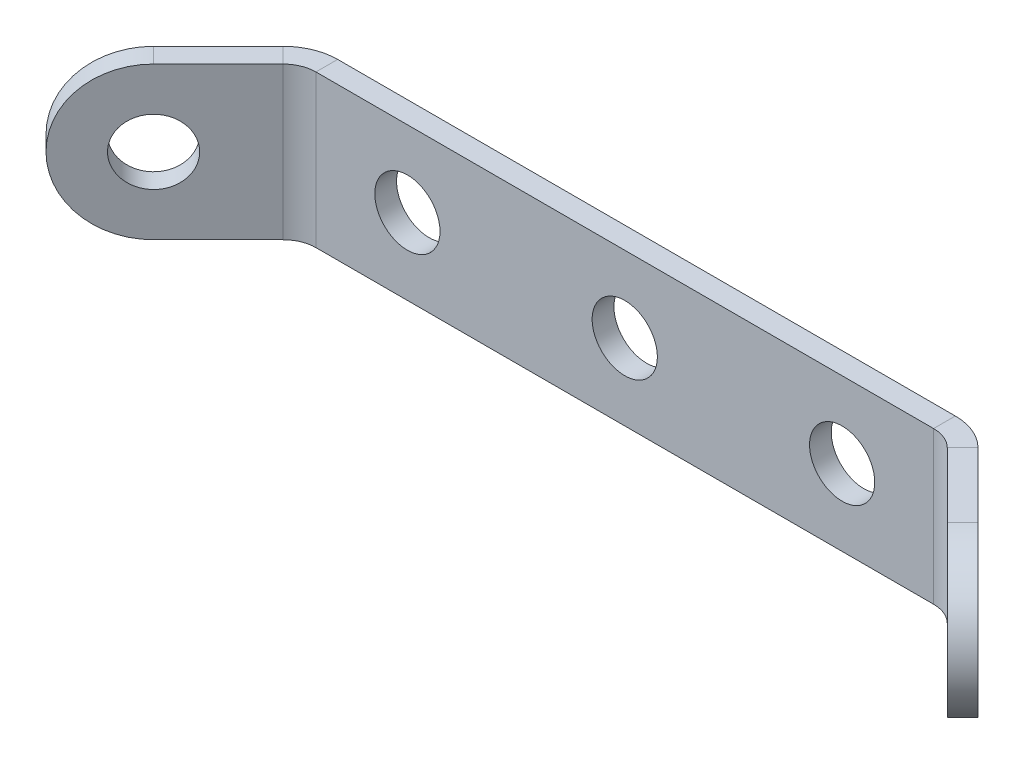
ISO-10303-21;
HEADER;
FILE_DESCRIPTION(('STEP AP214'),'2;1');
FILE_NAME('part.step','',(''),(''),'','','');
FILE_SCHEMA(('AUTOMOTIVE_DESIGN { 1 0 10303 214 1 1 1 1 }'));
ENDSEC;
DATA;
#1=APPLICATION_CONTEXT('core data for automotive mechanical design processes');
#2=APPLICATION_PROTOCOL_DEFINITION('international standard','automotive_design',2000,#1);
#3=PRODUCT_CONTEXT('',#1,'mechanical');
#4=PRODUCT('Part','Part','',(#3));
#5=PRODUCT_RELATED_PRODUCT_CATEGORY('part','',(#4));
#6=PRODUCT_DEFINITION_FORMATION('','',#4);
#7=PRODUCT_DEFINITION_CONTEXT('part definition',#1,'design');
#8=PRODUCT_DEFINITION('design','',#6,#7);
#9=PRODUCT_DEFINITION_SHAPE('','',#8);
#10=(LENGTH_UNIT() NAMED_UNIT(*) SI_UNIT(.MILLI.,.METRE.));
#11=(NAMED_UNIT(*) PLANE_ANGLE_UNIT() SI_UNIT($,.RADIAN.));
#12=(NAMED_UNIT(*) SI_UNIT($,.STERADIAN.) SOLID_ANGLE_UNIT());
#13=UNCERTAINTY_MEASURE_WITH_UNIT(LENGTH_MEASURE(1.E-05),#10,'distance_accuracy_value','');
#14=(GEOMETRIC_REPRESENTATION_CONTEXT(3) GLOBAL_UNCERTAINTY_ASSIGNED_CONTEXT((#13)) GLOBAL_UNIT_ASSIGNED_CONTEXT((#10,
#11,#12)) REPRESENTATION_CONTEXT('',''));
#15=CARTESIAN_POINT('',(0.,0.,0.));
#16=DIRECTION('',(0.,0.,1.));
#17=DIRECTION('',(1.,0.,0.));
#18=AXIS2_PLACEMENT_3D('',#15,#16,#17);
#19=CARTESIAN_POINT('',(-20.,3.5,-1.));
#20=DIRECTION('',(0.,1.,0.));
#21=DIRECTION('',(-1.,0.,0.));
#22=AXIS2_PLACEMENT_3D('',#19,#20,#21);
#23=PLANE('',#22);
#24=DIRECTION('',(-1.,0.,0.));
#25=VECTOR('',#24,1.);
#26=CARTESIAN_POINT('',(-20.,3.5,0.));
#27=LINE('',#26,#25);
#28=CARTESIAN_POINT('',(14.2071719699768,3.50000000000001,0.));
#29=VERTEX_POINT('',#28);
#30=CARTESIAN_POINT('',(-14.2071719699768,3.5,0.));
#31=VERTEX_POINT('',#30);
#32=EDGE_CURVE('E71',#29,#31,#27,.T.);
#33=ORIENTED_EDGE('',*,*,#32,.F.);
#34=DIRECTION('',(0.,0.,-1.));
#35=VECTOR('',#34,1.);
#36=CARTESIAN_POINT('',(14.2071719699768,3.50000000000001,-1.));
#37=LINE('',#36,#35);
#38=CARTESIAN_POINT('',(14.2071719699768,3.50000000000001,-1.));
#39=VERTEX_POINT('',#38);
#40=EDGE_CURVE('E266',#29,#39,#37,.T.);
#41=ORIENTED_EDGE('',*,*,#40,.T.);
#42=DIRECTION('',(-1.,0.,0.));
#43=VECTOR('',#42,1.);
#44=CARTESIAN_POINT('',(-20.,3.5,-1.));
#45=LINE('',#44,#43);
#46=CARTESIAN_POINT('',(-14.2071719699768,3.5,-1.));
#47=VERTEX_POINT('',#46);
#48=EDGE_CURVE('E50',#39,#47,#45,.T.);
#49=ORIENTED_EDGE('',*,*,#48,.T.);
#50=DIRECTION('',(0.,0.,-1.));
#51=VECTOR('',#50,1.);
#52=CARTESIAN_POINT('',(-14.2071719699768,3.5,-1.));
#53=LINE('',#52,#51);
#54=EDGE_CURVE('E261',#31,#47,#53,.T.);
#55=ORIENTED_EDGE('',*,*,#54,.F.);
#56=EDGE_LOOP('',(#33,#41,#49,#55));
#57=FACE_BOUND('',#56,.T.);
#58=ADVANCED_FACE('F46',(#57),#23,.T.);
#59=CARTESIAN_POINT('',(-20.,-3.5,-1.));
#60=DIRECTION('',(0.,-1.,0.));
#61=DIRECTION('',(1.,0.,0.));
#62=AXIS2_PLACEMENT_3D('',#59,#60,#61);
#63=PLANE('',#62);
#64=DIRECTION('',(1.,0.,0.));
#65=VECTOR('',#64,1.);
#66=CARTESIAN_POINT('',(-20.,-3.5,-1.));
#67=LINE('',#66,#65);
#68=CARTESIAN_POINT('',(-14.2071719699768,-3.5,-1.));
#69=VERTEX_POINT('',#68);
#70=CARTESIAN_POINT('',(14.2071719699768,-3.49999999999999,-1.));
#71=VERTEX_POINT('',#70);
#72=EDGE_CURVE('E270',#69,#71,#67,.T.);
#73=ORIENTED_EDGE('',*,*,#72,.T.);
#74=DIRECTION('',(0.,0.,1.));
#75=VECTOR('',#74,1.);
#76=CARTESIAN_POINT('',(14.2071719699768,-3.49999999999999,-1.));
#77=LINE('',#76,#75);
#78=CARTESIAN_POINT('',(14.2071719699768,-3.49999999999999,0.));
#79=VERTEX_POINT('',#78);
#80=EDGE_CURVE('E12',#71,#79,#77,.T.);
#81=ORIENTED_EDGE('',*,*,#80,.T.);
#82=DIRECTION('',(1.,0.,0.));
#83=VECTOR('',#82,1.);
#84=CARTESIAN_POINT('',(-20.,-3.5,0.));
#85=LINE('',#84,#83);
#86=CARTESIAN_POINT('',(-14.2071719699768,-3.5,0.));
#87=VERTEX_POINT('',#86);
#88=EDGE_CURVE('E250',#87,#79,#85,.T.);
#89=ORIENTED_EDGE('',*,*,#88,.F.);
#90=DIRECTION('',(0.,0.,1.));
#91=VECTOR('',#90,1.);
#92=CARTESIAN_POINT('',(-14.2071719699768,-3.5,-1.));
#93=LINE('',#92,#91);
#94=EDGE_CURVE('E255',#69,#87,#93,.T.);
#95=ORIENTED_EDGE('',*,*,#94,.F.);
#96=EDGE_LOOP('',(#73,#81,#89,#95));
#97=FACE_BOUND('',#96,.T.);
#98=ADVANCED_FACE('F48',(#97),#63,.T.);
#99=CARTESIAN_POINT('',(-20.,0.,0.));
#100=DIRECTION('',(0.,0.,1.));
#101=DIRECTION('',(1.,0.,0.));
#102=AXIS2_PLACEMENT_3D('',#99,#100,#101);
#103=PLANE('',#102);
#104=CARTESIAN_POINT('',(0.,0.,0.));
#105=DIRECTION('',(0.,0.,1.));
#106=DIRECTION('',(1.,0.,0.));
#107=AXIS2_PLACEMENT_3D('',#104,#105,#106);
#108=CIRCLE('',#107,1.5);
#109=CARTESIAN_POINT('',(1.5,0.,0.));
#110=VERTEX_POINT('',#109);
#111=EDGE_CURVE('E244',#110,#110,#108,.T.);
#112=ORIENTED_EDGE('',*,*,#111,.F.);
#113=EDGE_LOOP('',(#112));
#114=FACE_BOUND('',#113,.T.);
#115=CARTESIAN_POINT('',(10.,0.,0.));
#116=DIRECTION('',(0.,0.,1.));
#117=DIRECTION('',(1.,0.,0.));
#118=AXIS2_PLACEMENT_3D('',#115,#116,#117);
#119=CIRCLE('',#118,1.5);
#120=CARTESIAN_POINT('',(11.5,0.,0.));
#121=VERTEX_POINT('',#120);
#122=EDGE_CURVE('E238',#121,#121,#119,.T.);
#123=ORIENTED_EDGE('',*,*,#122,.F.);
#124=EDGE_LOOP('',(#123));
#125=FACE_BOUND('',#124,.T.);
#126=CARTESIAN_POINT('',(-10.,0.,0.));
#127=DIRECTION('',(0.,0.,1.));
#128=DIRECTION('',(1.,0.,0.));
#129=AXIS2_PLACEMENT_3D('',#126,#127,#128);
#130=CIRCLE('',#129,1.5);
#131=CARTESIAN_POINT('',(-8.5,0.,0.));
#132=VERTEX_POINT('',#131);
#133=EDGE_CURVE('E230',#132,#132,#130,.T.);
#134=ORIENTED_EDGE('',*,*,#133,.F.);
#135=EDGE_LOOP('',(#134));
#136=FACE_BOUND('',#135,.T.);
#137=ORIENTED_EDGE('',*,*,#88,.T.);
#138=DIRECTION('',(0.,1.,0.));
#139=VECTOR('',#138,1.);
#140=CARTESIAN_POINT('',(14.2071719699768,0.,0.));
#141=LINE('',#140,#139);
#142=EDGE_CURVE('E55',#79,#29,#141,.T.);
#143=ORIENTED_EDGE('',*,*,#142,.T.);
#144=ORIENTED_EDGE('',*,*,#32,.T.);
#145=DIRECTION('',(0.,1.,0.));
#146=VECTOR('',#145,1.);
#147=CARTESIAN_POINT('',(-14.2071719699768,0.,0.));
#148=LINE('',#147,#146);
#149=EDGE_CURVE('E258',#87,#31,#148,.T.);
#150=ORIENTED_EDGE('',*,*,#149,.F.);
#151=EDGE_LOOP('',(#137,#143,#144,#150));
#152=FACE_BOUND('',#151,.T.);
#153=ADVANCED_FACE('F274',(#114,#125,#136,#152),#103,.T.);
#154=CARTESIAN_POINT('',(-20.,0.,-1.));
#155=DIRECTION('',(0.,0.,1.));
#156=DIRECTION('',(1.,0.,0.));
#157=AXIS2_PLACEMENT_3D('',#154,#155,#156);
#158=PLANE('',#157);
#159=DIRECTION('',(0.,1.,0.));
#160=VECTOR('',#159,1.);
#161=CARTESIAN_POINT('',(14.2071719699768,0.,-1.));
#162=LINE('',#161,#160);
#163=EDGE_CURVE('E264',#71,#39,#162,.T.);
#164=ORIENTED_EDGE('',*,*,#163,.F.);
#165=ORIENTED_EDGE('',*,*,#72,.F.);
#166=DIRECTION('',(0.,1.,0.));
#167=VECTOR('',#166,1.);
#168=CARTESIAN_POINT('',(-14.2071719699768,0.,-1.));
#169=LINE('',#168,#167);
#170=EDGE_CURVE('E253',#69,#47,#169,.T.);
#171=ORIENTED_EDGE('',*,*,#170,.T.);
#172=ORIENTED_EDGE('',*,*,#48,.F.);
#173=EDGE_LOOP('',(#164,#165,#171,#172));
#174=FACE_BOUND('',#173,.T.);
#175=CARTESIAN_POINT('',(0.,0.,-1.));
#176=DIRECTION('',(0.,0.,1.));
#177=DIRECTION('',(1.,0.,0.));
#178=AXIS2_PLACEMENT_3D('',#175,#176,#177);
#179=CIRCLE('',#178,1.5);
#180=CARTESIAN_POINT('',(1.5,0.,-1.));
#181=VERTEX_POINT('',#180);
#182=EDGE_CURVE('E247',#181,#181,#179,.T.);
#183=ORIENTED_EDGE('',*,*,#182,.T.);
#184=EDGE_LOOP('',(#183));
#185=FACE_BOUND('',#184,.T.);
#186=CARTESIAN_POINT('',(10.,0.,-1.));
#187=DIRECTION('',(0.,0.,1.));
#188=DIRECTION('',(1.,0.,0.));
#189=AXIS2_PLACEMENT_3D('',#186,#187,#188);
#190=CIRCLE('',#189,1.5);
#191=CARTESIAN_POINT('',(11.5,0.,-1.));
#192=VERTEX_POINT('',#191);
#193=EDGE_CURVE('E241',#192,#192,#190,.T.);
#194=ORIENTED_EDGE('',*,*,#193,.T.);
#195=EDGE_LOOP('',(#194));
#196=FACE_BOUND('',#195,.T.);
#197=CARTESIAN_POINT('',(-10.,0.,-1.));
#198=DIRECTION('',(0.,0.,1.));
#199=DIRECTION('',(1.,0.,0.));
#200=AXIS2_PLACEMENT_3D('',#197,#198,#199);
#201=CIRCLE('',#200,1.5);
#202=CARTESIAN_POINT('',(-8.5,0.,-1.));
#203=VERTEX_POINT('',#202);
#204=EDGE_CURVE('E235',#203,#203,#201,.T.);
#205=ORIENTED_EDGE('',*,*,#204,.T.);
#206=EDGE_LOOP('',(#205));
#207=FACE_BOUND('',#206,.T.);
#208=ADVANCED_FACE('F286',(#174,#185,#196,#207),#158,.F.);
#209=CARTESIAN_POINT('',(0.,0.,-1.));
#210=DIRECTION('',(0.,0.,1.));
#211=DIRECTION('',(1.,0.,0.));
#212=AXIS2_PLACEMENT_3D('',#209,#210,#211);
#213=CYLINDRICAL_SURFACE('',#212,1.5);
#214=ORIENTED_EDGE('',*,*,#182,.F.);
#215=EDGE_LOOP('',(#214));
#216=FACE_BOUND('',#215,.T.);
#217=ORIENTED_EDGE('',*,*,#111,.T.);
#218=EDGE_LOOP('',(#217));
#219=FACE_BOUND('',#218,.T.);
#220=ADVANCED_FACE('F336',(#216,#219),#213,.F.);
#221=CARTESIAN_POINT('',(10.,0.,-1.));
#222=DIRECTION('',(0.,0.,1.));
#223=DIRECTION('',(1.,0.,0.));
#224=AXIS2_PLACEMENT_3D('',#221,#222,#223);
#225=CYLINDRICAL_SURFACE('',#224,1.5);
#226=ORIENTED_EDGE('',*,*,#193,.F.);
#227=EDGE_LOOP('',(#226));
#228=FACE_BOUND('',#227,.T.);
#229=ORIENTED_EDGE('',*,*,#122,.T.);
#230=EDGE_LOOP('',(#229));
#231=FACE_BOUND('',#230,.T.);
#232=ADVANCED_FACE('F346',(#228,#231),#225,.F.);
#233=CARTESIAN_POINT('',(-10.,0.,-1.));
#234=DIRECTION('',(0.,0.,1.));
#235=DIRECTION('',(1.,0.,0.));
#236=AXIS2_PLACEMENT_3D('',#233,#234,#235);
#237=CYLINDRICAL_SURFACE('',#236,1.5);
#238=ORIENTED_EDGE('',*,*,#204,.F.);
#239=EDGE_LOOP('',(#238));
#240=FACE_BOUND('',#239,.T.);
#241=ORIENTED_EDGE('',*,*,#133,.T.);
#242=EDGE_LOOP('',(#241));
#243=FACE_BOUND('',#242,.T.);
#244=ADVANCED_FACE('F343',(#240,#243),#237,.F.);
#245=CARTESIAN_POINT('',(-14.2071719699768,-3.5,1.51892));
#246=DIRECTION('',(0.,-1.,0.));
#247=DIRECTION('',(0.,0.,-1.));
#248=AXIS2_PLACEMENT_3D('',#245,#246,#247);
#249=PLANE('',#248);
#250=ORIENTED_EDGE('',*,*,#94,.T.);
#251=CARTESIAN_POINT('',(-14.2071719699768,-3.5,1.51892));
#252=DIRECTION('',(0.,1.,0.));
#253=DIRECTION('',(0.,0.,1.));
#254=AXIS2_PLACEMENT_3D('',#251,#252,#253);
#255=CIRCLE('',#254,1.51892);
#256=CARTESIAN_POINT('',(-15.2812106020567,-3.5,0.444881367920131));
#257=VERTEX_POINT('',#256);
#258=EDGE_CURVE('E189',#87,#257,#255,.T.);
#259=ORIENTED_EDGE('',*,*,#258,.T.);
#260=DIRECTION('',(0.707106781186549,0.,0.707106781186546));
#261=VECTOR('',#260,1.);
#262=CARTESIAN_POINT('',(-15.9883173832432,-3.5,-0.262225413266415));
#263=LINE('',#262,#261);
#264=CARTESIAN_POINT('',(-15.9883173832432,-3.5,-0.262225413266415));
#265=VERTEX_POINT('',#264);
#266=EDGE_CURVE('E204',#265,#257,#263,.T.);
#267=ORIENTED_EDGE('',*,*,#266,.F.);
#268=CARTESIAN_POINT('',(-14.2071719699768,-3.5,1.51892));
#269=DIRECTION('',(0.,1.,0.));
#270=DIRECTION('',(0.,0.,-1.));
#271=AXIS2_PLACEMENT_3D('',#268,#269,#270);
#272=CIRCLE('',#271,2.51892);
#273=EDGE_CURVE('E223',#69,#265,#272,.T.);
#274=ORIENTED_EDGE('',*,*,#273,.F.);
#275=EDGE_LOOP('',(#250,#259,#267,#274));
#276=FACE_BOUND('',#275,.T.);
#277=ADVANCED_FACE('F345',(#276),#249,.T.);
#278=CARTESIAN_POINT('',(-14.2071719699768,3.5,1.51892));
#279=DIRECTION('',(0.,1.,0.));
#280=DIRECTION('',(0.,0.,1.));
#281=AXIS2_PLACEMENT_3D('',#278,#279,#280);
#282=PLANE('',#281);
#283=DIRECTION('',(-0.707106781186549,0.,-0.707106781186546));
#284=VECTOR('',#283,1.);
#285=CARTESIAN_POINT('',(-15.9883173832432,3.5,-0.262225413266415));
#286=LINE('',#285,#284);
#287=CARTESIAN_POINT('',(-15.2812106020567,3.5,0.444881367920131));
#288=VERTEX_POINT('',#287);
#289=CARTESIAN_POINT('',(-15.9883173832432,3.5,-0.262225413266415));
#290=VERTEX_POINT('',#289);
#291=EDGE_CURVE('E192',#288,#290,#286,.T.);
#292=ORIENTED_EDGE('',*,*,#291,.F.);
#293=CARTESIAN_POINT('',(-14.2071719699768,3.49999999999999,1.51892));
#294=DIRECTION('',(0.,1.,0.));
#295=DIRECTION('',(0.,0.,1.));
#296=AXIS2_PLACEMENT_3D('',#293,#294,#295);
#297=CIRCLE('',#296,1.51892);
#298=EDGE_CURVE('E227',#288,#31,#297,.F.);
#299=ORIENTED_EDGE('',*,*,#298,.T.);
#300=ORIENTED_EDGE('',*,*,#54,.T.);
#301=CARTESIAN_POINT('',(-14.2071719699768,3.5,1.51892));
#302=DIRECTION('',(0.,-1.,0.));
#303=DIRECTION('',(0.,0.,1.));
#304=AXIS2_PLACEMENT_3D('',#301,#302,#303);
#305=CIRCLE('',#304,2.51892);
#306=EDGE_CURVE('E226',#290,#47,#305,.T.);
#307=ORIENTED_EDGE('',*,*,#306,.F.);
#308=EDGE_LOOP('',(#292,#299,#300,#307));
#309=FACE_BOUND('',#308,.T.);
#310=ADVANCED_FACE('F353',(#309),#282,.T.);
#311=CARTESIAN_POINT('',(-14.2071719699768,-7.24667545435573,1.51892));
#312=DIRECTION('',(0.,1.,0.));
#313=DIRECTION('',(0.,0.,1.));
#314=AXIS2_PLACEMENT_3D('',#311,#312,#313);
#315=CYLINDRICAL_SURFACE('',#314,2.51892);
#316=ORIENTED_EDGE('',*,*,#306,.T.);
#317=ORIENTED_EDGE('',*,*,#170,.F.);
#318=ORIENTED_EDGE('',*,*,#273,.T.);
#319=DIRECTION('',(0.,1.,0.));
#320=VECTOR('',#319,1.);
#321=CARTESIAN_POINT('',(-15.9883173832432,0.,-0.262225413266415));
#322=LINE('',#321,#320);
#323=EDGE_CURVE('E182',#265,#290,#322,.T.);
#324=ORIENTED_EDGE('',*,*,#323,.T.);
#325=EDGE_LOOP('',(#316,#317,#318,#324));
#326=FACE_BOUND('',#325,.T.);
#327=ADVANCED_FACE('F421',(#326),#315,.T.);
#328=CARTESIAN_POINT('',(-14.2071719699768,-7.24667545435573,1.51892));
#329=DIRECTION('',(0.,1.,0.));
#330=DIRECTION('',(0.,0.,1.));
#331=AXIS2_PLACEMENT_3D('',#328,#329,#330);
#332=CYLINDRICAL_SURFACE('',#331,1.51892);
#333=ORIENTED_EDGE('',*,*,#298,.F.);
#334=DIRECTION('',(0.,1.,0.));
#335=VECTOR('',#334,1.);
#336=CARTESIAN_POINT('',(-15.2812106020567,0.,0.444881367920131));
#337=LINE('',#336,#335);
#338=EDGE_CURVE('E199',#257,#288,#337,.T.);
#339=ORIENTED_EDGE('',*,*,#338,.F.);
#340=ORIENTED_EDGE('',*,*,#258,.F.);
#341=ORIENTED_EDGE('',*,*,#149,.T.);
#342=EDGE_LOOP('',(#333,#339,#340,#341));
#343=FACE_BOUND('',#342,.T.);
#344=ADVANCED_FACE('F431',(#343),#332,.F.);
#345=CARTESIAN_POINT('',(-18.9632372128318,0.,2.71269441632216));
#346=DIRECTION('',(0.707106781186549,0.,0.707106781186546));
#347=DIRECTION('',(0.707106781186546,0.,-0.707106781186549));
#348=AXIS2_PLACEMENT_3D('',#345,#346,#347);
#349=CYLINDRICAL_SURFACE('',#348,1.5);
#350=CARTESIAN_POINT('',(-18.9632372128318,0.,2.71269441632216));
#351=DIRECTION('',(0.707106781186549,0.,0.707106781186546));
#352=DIRECTION('',(0.707106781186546,0.,-0.707106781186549));
#353=AXIS2_PLACEMENT_3D('',#350,#351,#352);
#354=CIRCLE('',#353,1.5);
#355=CARTESIAN_POINT('',(-17.902577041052,0.,1.65203424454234));
#356=VERTEX_POINT('',#355);
#357=EDGE_CURVE('E210',#356,#356,#354,.T.);
#358=ORIENTED_EDGE('',*,*,#357,.F.);
#359=EDGE_LOOP('',(#358));
#360=FACE_BOUND('',#359,.T.);
#361=CARTESIAN_POINT('',(-18.2561304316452,0.,3.41980119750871));
#362=DIRECTION('',(0.707106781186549,0.,0.707106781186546));
#363=DIRECTION('',(0.707106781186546,0.,-0.707106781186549));
#364=AXIS2_PLACEMENT_3D('',#361,#362,#363);
#365=CIRCLE('',#364,1.5);
#366=CARTESIAN_POINT('',(-17.1954702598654,0.,2.35914102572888));
#367=VERTEX_POINT('',#366);
#368=EDGE_CURVE('E218',#367,#367,#365,.T.);
#369=ORIENTED_EDGE('',*,*,#368,.T.);
#370=EDGE_LOOP('',(#369));
#371=FACE_BOUND('',#370,.T.);
#372=ADVANCED_FACE('F442',(#360,#371),#349,.F.);
#373=CARTESIAN_POINT('',(-18.9632372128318,0.,2.71269441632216));
#374=DIRECTION('',(0.707106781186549,0.,0.707106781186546));
#375=DIRECTION('',(0.707106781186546,0.,-0.707106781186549));
#376=AXIS2_PLACEMENT_3D('',#373,#374,#375);
#377=CYLINDRICAL_SURFACE('',#376,3.5);
#378=CARTESIAN_POINT('',(-18.2561304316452,0.,3.41980119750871));
#379=DIRECTION('',(0.707106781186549,0.,0.707106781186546));
#380=DIRECTION('',(0.707106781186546,0.,-0.707106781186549));
#381=AXIS2_PLACEMENT_3D('',#378,#379,#380);
#382=CIRCLE('',#381,3.5);
#383=CARTESIAN_POINT('',(-18.2561304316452,3.5,3.41980119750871));
#384=VERTEX_POINT('',#383);
#385=CARTESIAN_POINT('',(-18.2561304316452,-3.5,3.41980119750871));
#386=VERTEX_POINT('',#385);
#387=EDGE_CURVE('E194',#384,#386,#382,.T.);
#388=ORIENTED_EDGE('',*,*,#387,.F.);
#389=DIRECTION('',(0.707106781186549,0.,0.707106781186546));
#390=VECTOR('',#389,1.);
#391=CARTESIAN_POINT('',(-18.9632372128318,3.5,2.71269441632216));
#392=LINE('',#391,#390);
#393=CARTESIAN_POINT('',(-18.9632372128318,3.5,2.71269441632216));
#394=VERTEX_POINT('',#393);
#395=EDGE_CURVE('E186',#394,#384,#392,.T.);
#396=ORIENTED_EDGE('',*,*,#395,.F.);
#397=CARTESIAN_POINT('',(-18.9632372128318,0.,2.71269441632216));
#398=DIRECTION('',(0.707106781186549,0.,0.707106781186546));
#399=DIRECTION('',(0.707106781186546,0.,-0.707106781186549));
#400=AXIS2_PLACEMENT_3D('',#397,#398,#399);
#401=CIRCLE('',#400,3.5);
#402=CARTESIAN_POINT('',(-18.9632372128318,-3.5,2.71269441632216));
#403=VERTEX_POINT('',#402);
#404=EDGE_CURVE('E215',#394,#403,#401,.T.);
#405=ORIENTED_EDGE('',*,*,#404,.T.);
#406=DIRECTION('',(0.707106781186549,0.,0.707106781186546));
#407=VECTOR('',#406,1.);
#408=CARTESIAN_POINT('',(-18.9632372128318,-3.5,2.71269441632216));
#409=LINE('',#408,#407);
#410=EDGE_CURVE('E213',#403,#386,#409,.T.);
#411=ORIENTED_EDGE('',*,*,#410,.T.);
#412=EDGE_LOOP('',(#388,#396,#405,#411));
#413=FACE_BOUND('',#412,.T.);
#414=ADVANCED_FACE('F453',(#413),#377,.T.);
#415=CARTESIAN_POINT('',(-18.9632372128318,0.,2.71269441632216));
#416=DIRECTION('',(0.707106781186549,0.,0.707106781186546));
#417=DIRECTION('',(0.707106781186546,0.,-0.707106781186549));
#418=AXIS2_PLACEMENT_3D('',#415,#416,#417);
#419=PLANE('',#418);
#420=ORIENTED_EDGE('',*,*,#323,.F.);
#421=DIRECTION('',(0.707106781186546,0.,-0.707106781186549));
#422=VECTOR('',#421,1.);
#423=CARTESIAN_POINT('',(-18.9632372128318,-3.5,2.71269441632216));
#424=LINE('',#423,#422);
#425=EDGE_CURVE('E207',#403,#265,#424,.T.);
#426=ORIENTED_EDGE('',*,*,#425,.F.);
#427=ORIENTED_EDGE('',*,*,#404,.F.);
#428=DIRECTION('',(-0.707106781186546,0.,0.707106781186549));
#429=VECTOR('',#428,1.);
#430=CARTESIAN_POINT('',(-18.9632372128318,3.5,2.71269441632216));
#431=LINE('',#430,#429);
#432=EDGE_CURVE('E190',#290,#394,#431,.T.);
#433=ORIENTED_EDGE('',*,*,#432,.F.);
#434=EDGE_LOOP('',(#420,#426,#427,#433));
#435=FACE_BOUND('',#434,.T.);
#436=ORIENTED_EDGE('',*,*,#357,.T.);
#437=EDGE_LOOP('',(#436));
#438=FACE_BOUND('',#437,.T.);
#439=ADVANCED_FACE('F464',(#435,#438),#419,.F.);
#440=CARTESIAN_POINT('',(-18.9632372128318,-3.5,2.71269441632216));
#441=DIRECTION('',(0.,-1.,0.));
#442=DIRECTION('',(0.707106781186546,0.,-0.707106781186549));
#443=AXIS2_PLACEMENT_3D('',#440,#441,#442);
#444=PLANE('',#443);
#445=ORIENTED_EDGE('',*,*,#425,.T.);
#446=ORIENTED_EDGE('',*,*,#266,.T.);
#447=DIRECTION('',(0.707106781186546,0.,-0.707106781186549));
#448=VECTOR('',#447,1.);
#449=CARTESIAN_POINT('',(-18.2561304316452,-3.5,3.41980119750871));
#450=LINE('',#449,#448);
#451=EDGE_CURVE('E202',#386,#257,#450,.T.);
#452=ORIENTED_EDGE('',*,*,#451,.F.);
#453=ORIENTED_EDGE('',*,*,#410,.F.);
#454=EDGE_LOOP('',(#445,#446,#452,#453));
#455=FACE_BOUND('',#454,.T.);
#456=ADVANCED_FACE('F475',(#455),#444,.T.);
#457=CARTESIAN_POINT('',(-18.2561304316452,0.,3.41980119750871));
#458=DIRECTION('',(0.707106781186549,0.,0.707106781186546));
#459=DIRECTION('',(0.707106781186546,0.,-0.707106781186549));
#460=AXIS2_PLACEMENT_3D('',#457,#458,#459);
#461=PLANE('',#460);
#462=ORIENTED_EDGE('',*,*,#368,.F.);
#463=EDGE_LOOP('',(#462));
#464=FACE_BOUND('',#463,.T.);
#465=ORIENTED_EDGE('',*,*,#451,.T.);
#466=ORIENTED_EDGE('',*,*,#338,.T.);
#467=DIRECTION('',(-0.707106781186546,0.,0.707106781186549));
#468=VECTOR('',#467,1.);
#469=CARTESIAN_POINT('',(-18.2561304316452,3.5,3.41980119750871));
#470=LINE('',#469,#468);
#471=EDGE_CURVE('E197',#288,#384,#470,.T.);
#472=ORIENTED_EDGE('',*,*,#471,.T.);
#473=ORIENTED_EDGE('',*,*,#387,.T.);
#474=EDGE_LOOP('',(#465,#466,#472,#473));
#475=FACE_BOUND('',#474,.T.);
#476=ADVANCED_FACE('F486',(#464,#475),#461,.T.);
#477=CARTESIAN_POINT('',(-18.9632372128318,3.5,2.71269441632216));
#478=DIRECTION('',(0.,1.,0.));
#479=DIRECTION('',(-0.707106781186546,0.,0.707106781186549));
#480=AXIS2_PLACEMENT_3D('',#477,#478,#479);
#481=PLANE('',#480);
#482=ORIENTED_EDGE('',*,*,#471,.F.);
#483=ORIENTED_EDGE('',*,*,#291,.T.);
#484=ORIENTED_EDGE('',*,*,#432,.T.);
#485=ORIENTED_EDGE('',*,*,#395,.T.);
#486=EDGE_LOOP('',(#482,#483,#484,#485));
#487=FACE_BOUND('',#486,.T.);
#488=ADVANCED_FACE('F497',(#487),#481,.T.);
#489=CARTESIAN_POINT('',(14.2071719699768,-3.49999999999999,1.51892));
#490=DIRECTION('',(0.,-1.,0.));
#491=DIRECTION('',(0.,0.,-1.));
#492=AXIS2_PLACEMENT_3D('',#489,#490,#491);
#493=PLANE('',#492);
#494=DIRECTION('',(-0.707106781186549,0.,0.707106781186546));
#495=VECTOR('',#494,1.);
#496=CARTESIAN_POINT('',(15.9883173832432,-3.49999999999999,-0.262225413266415));
#497=LINE('',#496,#495);
#498=CARTESIAN_POINT('',(15.9883173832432,-3.49999999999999,-0.262225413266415));
#499=VERTEX_POINT('',#498);
#500=CARTESIAN_POINT('',(15.2812106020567,-3.49999999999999,0.444881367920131));
#501=VERTEX_POINT('',#500);
#502=EDGE_CURVE('E145',#499,#501,#497,.T.);
#503=ORIENTED_EDGE('',*,*,#502,.T.);
#504=CARTESIAN_POINT('',(14.2071719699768,-3.49999999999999,1.51892));
#505=DIRECTION('',(0.,-1.,0.));
#506=DIRECTION('',(0.,0.,-1.));
#507=AXIS2_PLACEMENT_3D('',#504,#505,#506);
#508=CIRCLE('',#507,1.51892);
#509=EDGE_CURVE('E63',#501,#79,#508,.F.);
#510=ORIENTED_EDGE('',*,*,#509,.T.);
#511=ORIENTED_EDGE('',*,*,#80,.F.);
#512=CARTESIAN_POINT('',(14.2071719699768,-3.49999999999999,1.51892));
#513=DIRECTION('',(0.,1.,0.));
#514=DIRECTION('',(0.,0.,-1.));
#515=AXIS2_PLACEMENT_3D('',#512,#513,#514);
#516=CIRCLE('',#515,2.51892);
#517=EDGE_CURVE('E175',#499,#71,#516,.T.);
#518=ORIENTED_EDGE('',*,*,#517,.F.);
#519=EDGE_LOOP('',(#503,#510,#511,#518));
#520=FACE_BOUND('',#519,.T.);
#521=ADVANCED_FACE('F277',(#520),#493,.T.);
#522=CARTESIAN_POINT('',(14.2071719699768,3.50000000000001,1.51892));
#523=DIRECTION('',(0.,1.,0.));
#524=DIRECTION('',(0.,0.,1.));
#525=AXIS2_PLACEMENT_3D('',#522,#523,#524);
#526=PLANE('',#525);
#527=ORIENTED_EDGE('',*,*,#40,.F.);
#528=CARTESIAN_POINT('',(14.2071719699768,3.50000000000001,1.51892));
#529=DIRECTION('',(0.,-1.,0.));
#530=DIRECTION('',(0.,0.,-1.));
#531=AXIS2_PLACEMENT_3D('',#528,#529,#530);
#532=CIRCLE('',#531,1.51892);
#533=CARTESIAN_POINT('',(15.2812106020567,3.50000000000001,0.444881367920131));
#534=VERTEX_POINT('',#533);
#535=EDGE_CURVE('E179',#29,#534,#532,.T.);
#536=ORIENTED_EDGE('',*,*,#535,.T.);
#537=DIRECTION('',(0.707106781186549,0.,-0.707106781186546));
#538=VECTOR('',#537,1.);
#539=CARTESIAN_POINT('',(15.9883173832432,3.50000000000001,-0.262225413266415));
#540=LINE('',#539,#538);
#541=CARTESIAN_POINT('',(15.9883173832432,3.50000000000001,-0.262225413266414));
#542=VERTEX_POINT('',#541);
#543=EDGE_CURVE('E163',#534,#542,#540,.T.);
#544=ORIENTED_EDGE('',*,*,#543,.T.);
#545=CARTESIAN_POINT('',(14.2071719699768,3.50000000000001,1.51892));
#546=DIRECTION('',(0.,-1.,0.));
#547=DIRECTION('',(0.,0.,1.));
#548=AXIS2_PLACEMENT_3D('',#545,#546,#547);
#549=CIRCLE('',#548,2.51892);
#550=EDGE_CURVE('E178',#39,#542,#549,.T.);
#551=ORIENTED_EDGE('',*,*,#550,.F.);
#552=EDGE_LOOP('',(#527,#536,#544,#551));
#553=FACE_BOUND('',#552,.T.);
#554=ADVANCED_FACE('F293',(#553),#526,.T.);
#555=CARTESIAN_POINT('',(14.2071719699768,7.24667545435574,1.51892));
#556=DIRECTION('',(0.,-1.,0.));
#557=DIRECTION('',(0.,0.,-1.));
#558=AXIS2_PLACEMENT_3D('',#555,#556,#557);
#559=CYLINDRICAL_SURFACE('',#558,2.51892);
#560=ORIENTED_EDGE('',*,*,#550,.T.);
#561=DIRECTION('',(0.,1.,0.));
#562=VECTOR('',#561,1.);
#563=CARTESIAN_POINT('',(15.9883173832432,0.,-0.262225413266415));
#564=LINE('',#563,#562);
#565=EDGE_CURVE('E283',#499,#542,#564,.T.);
#566=ORIENTED_EDGE('',*,*,#565,.F.);
#567=ORIENTED_EDGE('',*,*,#517,.T.);
#568=ORIENTED_EDGE('',*,*,#163,.T.);
#569=EDGE_LOOP('',(#560,#566,#567,#568));
#570=FACE_BOUND('',#569,.T.);
#571=ADVANCED_FACE('F281',(#570),#559,.T.);
#572=CARTESIAN_POINT('',(14.2071719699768,7.24667545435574,1.51892));
#573=DIRECTION('',(0.,-1.,0.));
#574=DIRECTION('',(0.,0.,-1.));
#575=AXIS2_PLACEMENT_3D('',#572,#573,#574);
#576=CYLINDRICAL_SURFACE('',#575,1.51892);
#577=ORIENTED_EDGE('',*,*,#535,.F.);
#578=ORIENTED_EDGE('',*,*,#142,.F.);
#579=ORIENTED_EDGE('',*,*,#509,.F.);
#580=DIRECTION('',(0.,1.,0.));
#581=VECTOR('',#580,1.);
#582=CARTESIAN_POINT('',(15.2812106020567,0.,0.444881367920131));
#583=LINE('',#582,#581);
#584=EDGE_CURVE('E168',#501,#534,#583,.T.);
#585=ORIENTED_EDGE('',*,*,#584,.T.);
#586=EDGE_LOOP('',(#577,#578,#579,#585));
#587=FACE_BOUND('',#586,.T.);
#588=ADVANCED_FACE('F295',(#587),#576,.F.);
#589=CARTESIAN_POINT('',(18.9632372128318,0.,2.71269441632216));
#590=DIRECTION('',(-0.707106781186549,0.,0.707106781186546));
#591=DIRECTION('',(0.707106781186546,0.,0.707106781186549));
#592=AXIS2_PLACEMENT_3D('',#589,#590,#591);
#593=CYLINDRICAL_SURFACE('',#592,3.5);
#594=CARTESIAN_POINT('',(18.2561304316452,0.,3.41980119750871));
#595=DIRECTION('',(-0.707106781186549,0.,0.707106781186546));
#596=DIRECTION('',(0.707106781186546,0.,0.707106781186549));
#597=AXIS2_PLACEMENT_3D('',#594,#595,#596);
#598=CIRCLE('',#597,3.5);
#599=CARTESIAN_POINT('',(18.2561304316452,-3.49999999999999,3.41980119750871));
#600=VERTEX_POINT('',#599);
#601=CARTESIAN_POINT('',(18.2561304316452,3.50000000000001,3.41980119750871));
#602=VERTEX_POINT('',#601);
#603=EDGE_CURVE('E158',#600,#602,#598,.T.);
#604=ORIENTED_EDGE('',*,*,#603,.F.);
#605=DIRECTION('',(-0.707106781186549,0.,0.707106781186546));
#606=VECTOR('',#605,1.);
#607=CARTESIAN_POINT('',(18.9632372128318,-3.49999999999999,2.71269441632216));
#608=LINE('',#607,#606);
#609=CARTESIAN_POINT('',(18.9632372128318,-3.49999999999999,2.71269441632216));
#610=VERTEX_POINT('',#609);
#611=EDGE_CURVE('E143',#610,#600,#608,.T.);
#612=ORIENTED_EDGE('',*,*,#611,.F.);
#613=CARTESIAN_POINT('',(18.9632372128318,0.,2.71269441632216));
#614=DIRECTION('',(-0.707106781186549,0.,0.707106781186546));
#615=DIRECTION('',(0.707106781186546,0.,0.707106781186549));
#616=AXIS2_PLACEMENT_3D('',#613,#614,#615);
#617=CIRCLE('',#616,3.5);
#618=CARTESIAN_POINT('',(18.9632372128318,3.50000000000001,2.71269441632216));
#619=VERTEX_POINT('',#618);
#620=EDGE_CURVE('E155',#610,#619,#617,.T.);
#621=ORIENTED_EDGE('',*,*,#620,.T.);
#622=DIRECTION('',(-0.707106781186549,0.,0.707106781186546));
#623=VECTOR('',#622,1.);
#624=CARTESIAN_POINT('',(18.9632372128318,3.50000000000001,2.71269441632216));
#625=LINE('',#624,#623);
#626=EDGE_CURVE('E162',#619,#602,#625,.T.);
#627=ORIENTED_EDGE('',*,*,#626,.T.);
#628=EDGE_LOOP('',(#604,#612,#621,#627));
#629=FACE_BOUND('',#628,.T.);
#630=ADVANCED_FACE('F154',(#629),#593,.T.);
#631=CARTESIAN_POINT('',(18.9632372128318,0.,2.71269441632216));
#632=DIRECTION('',(-0.707106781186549,0.,0.707106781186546));
#633=DIRECTION('',(0.707106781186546,0.,0.707106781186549));
#634=AXIS2_PLACEMENT_3D('',#631,#632,#633);
#635=CYLINDRICAL_SURFACE('',#634,1.5);
#636=CARTESIAN_POINT('',(18.9632372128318,0.,2.71269441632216));
#637=DIRECTION('',(-0.707106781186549,0.,0.707106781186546));
#638=DIRECTION('',(0.707106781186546,0.,0.707106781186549));
#639=AXIS2_PLACEMENT_3D('',#636,#637,#638);
#640=CIRCLE('',#639,1.5);
#641=CARTESIAN_POINT('',(20.0238973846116,0.,3.77335458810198));
#642=VERTEX_POINT('',#641);
#643=EDGE_CURVE('E307',#642,#642,#640,.T.);
#644=ORIENTED_EDGE('',*,*,#643,.F.);
#645=EDGE_LOOP('',(#644));
#646=FACE_BOUND('',#645,.T.);
#647=CARTESIAN_POINT('',(18.2561304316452,0.,3.41980119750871));
#648=DIRECTION('',(-0.707106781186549,0.,0.707106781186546));
#649=DIRECTION('',(0.707106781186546,0.,0.707106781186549));
#650=AXIS2_PLACEMENT_3D('',#647,#648,#649);
#651=CIRCLE('',#650,1.5);
#652=CARTESIAN_POINT('',(19.3167906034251,0.,4.48046136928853));
#653=VERTEX_POINT('',#652);
#654=EDGE_CURVE('E165',#653,#653,#651,.T.);
#655=ORIENTED_EDGE('',*,*,#654,.T.);
#656=EDGE_LOOP('',(#655));
#657=FACE_BOUND('',#656,.T.);
#658=ADVANCED_FACE('F315',(#646,#657),#635,.F.);
#659=CARTESIAN_POINT('',(-9.32103403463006,0.,-25.5715768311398));
#660=DIRECTION('',(-0.707106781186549,0.,0.707106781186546));
#661=DIRECTION('',(0.707106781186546,0.,0.707106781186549));
#662=AXIS2_PLACEMENT_3D('',#659,#660,#661);
#663=PLANE('',#662);
#664=ORIENTED_EDGE('',*,*,#643,.T.);
#665=EDGE_LOOP('',(#664));
#666=FACE_BOUND('',#665,.T.);
#667=DIRECTION('',(0.707106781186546,0.,0.707106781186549));
#668=VECTOR('',#667,1.);
#669=CARTESIAN_POINT('',(-9.32103403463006,-3.5,-25.5715768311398));
#670=LINE('',#669,#668);
#671=EDGE_CURVE('E140',#499,#610,#670,.T.);
#672=ORIENTED_EDGE('',*,*,#671,.F.);
#673=ORIENTED_EDGE('',*,*,#565,.T.);
#674=DIRECTION('',(-0.707106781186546,0.,-0.707106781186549));
#675=VECTOR('',#674,1.);
#676=CARTESIAN_POINT('',(-9.32103403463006,3.5,-25.5715768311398));
#677=LINE('',#676,#675);
#678=EDGE_CURVE('E161',#619,#542,#677,.T.);
#679=ORIENTED_EDGE('',*,*,#678,.F.);
#680=ORIENTED_EDGE('',*,*,#620,.F.);
#681=EDGE_LOOP('',(#672,#673,#679,#680));
#682=FACE_BOUND('',#681,.T.);
#683=ADVANCED_FACE('F160',(#666,#682),#663,.F.);
#684=CARTESIAN_POINT('',(-9.32103403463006,3.5,-25.5715768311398));
#685=DIRECTION('',(0.,1.,0.));
#686=DIRECTION('',(-0.707106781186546,0.,-0.707106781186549));
#687=AXIS2_PLACEMENT_3D('',#684,#685,#686);
#688=PLANE('',#687);
#689=ORIENTED_EDGE('',*,*,#543,.F.);
#690=DIRECTION('',(-0.707106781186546,0.,-0.707106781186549));
#691=VECTOR('',#690,1.);
#692=CARTESIAN_POINT('',(-10.0281408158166,3.5,-24.8644700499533));
#693=LINE('',#692,#691);
#694=EDGE_CURVE('E150',#602,#534,#693,.T.);
#695=ORIENTED_EDGE('',*,*,#694,.F.);
#696=ORIENTED_EDGE('',*,*,#626,.F.);
#697=ORIENTED_EDGE('',*,*,#678,.T.);
#698=EDGE_LOOP('',(#689,#695,#696,#697));
#699=FACE_BOUND('',#698,.T.);
#700=ADVANCED_FACE('F305',(#699),#688,.T.);
#701=CARTESIAN_POINT('',(-10.0281408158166,0.,-24.8644700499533));
#702=DIRECTION('',(-0.707106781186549,0.,0.707106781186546));
#703=DIRECTION('',(0.707106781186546,0.,0.707106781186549));
#704=AXIS2_PLACEMENT_3D('',#701,#702,#703);
#705=PLANE('',#704);
#706=ORIENTED_EDGE('',*,*,#584,.F.);
#707=DIRECTION('',(0.707106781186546,0.,0.707106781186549));
#708=VECTOR('',#707,1.);
#709=CARTESIAN_POINT('',(-10.0281408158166,-3.5,-24.8644700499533));
#710=LINE('',#709,#708);
#711=EDGE_CURVE('E300',#501,#600,#710,.T.);
#712=ORIENTED_EDGE('',*,*,#711,.T.);
#713=ORIENTED_EDGE('',*,*,#603,.T.);
#714=ORIENTED_EDGE('',*,*,#694,.T.);
#715=EDGE_LOOP('',(#706,#712,#713,#714));
#716=FACE_BOUND('',#715,.T.);
#717=ORIENTED_EDGE('',*,*,#654,.F.);
#718=EDGE_LOOP('',(#717));
#719=FACE_BOUND('',#718,.T.);
#720=ADVANCED_FACE('F298',(#716,#719),#705,.T.);
#721=CARTESIAN_POINT('',(-9.32103403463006,-3.5,-25.5715768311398));
#722=DIRECTION('',(0.,-1.,0.));
#723=DIRECTION('',(0.707106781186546,0.,0.707106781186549));
#724=AXIS2_PLACEMENT_3D('',#721,#722,#723);
#725=PLANE('',#724);
#726=ORIENTED_EDGE('',*,*,#502,.F.);
#727=ORIENTED_EDGE('',*,*,#671,.T.);
#728=ORIENTED_EDGE('',*,*,#611,.T.);
#729=ORIENTED_EDGE('',*,*,#711,.F.);
#730=EDGE_LOOP('',(#726,#727,#728,#729));
#731=FACE_BOUND('',#730,.T.);
#732=ADVANCED_FACE('F142',(#731),#725,.T.);
#733=CLOSED_SHELL('',(#58,#98,#153,#208,#220,#232,#244,#277,#310,#327,#344,#372,#414,#439,#456,
#476,#488,#521,#554,#571,#588,#630,#658,#683,#700,#720,#732));
#734=MANIFOLD_SOLID_BREP('B2',#733);
#735=ADVANCED_BREP_SHAPE_REPRESENTATION('',(#18,#734),#14);
#736=SHAPE_DEFINITION_REPRESENTATION(#9,#735);
ENDSEC;
END-ISO-10303-21;
